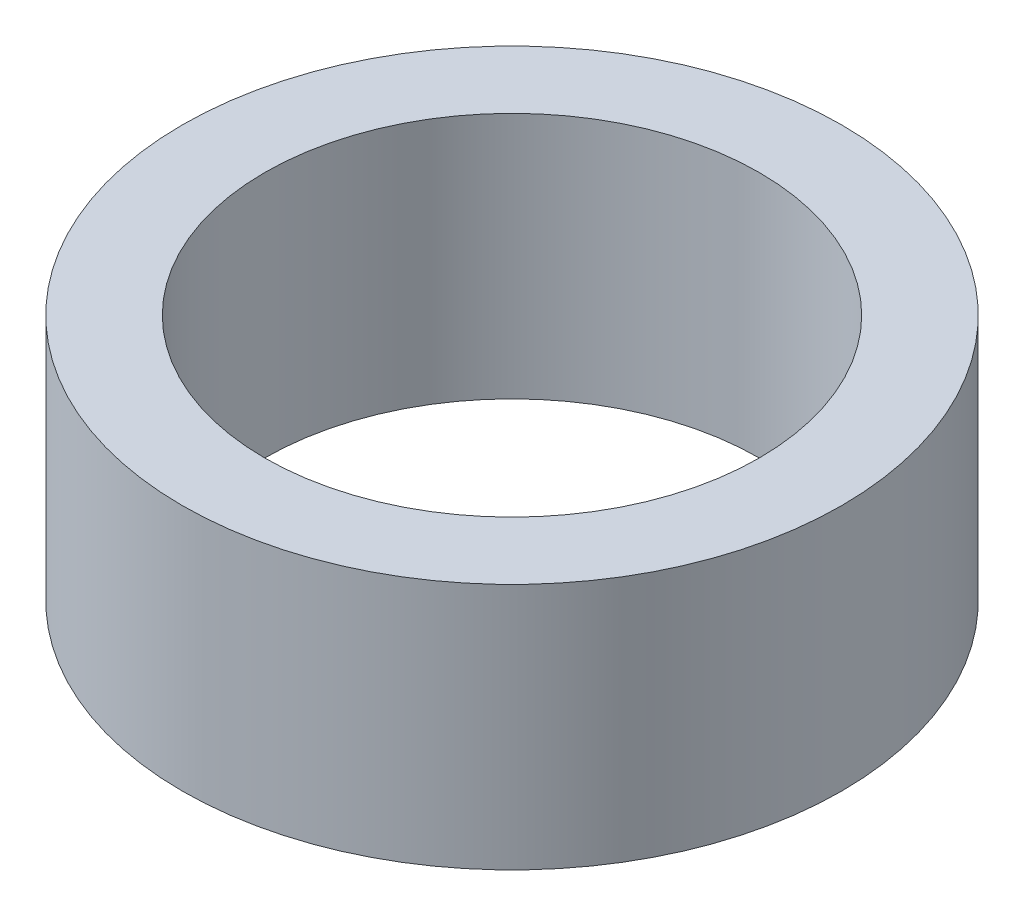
from build123d import *

# Parameters (mm, degrees)
SKETCH1_R           = 2
SKETCH1_R_2         = 1.5
BOSS_EXTRUDE1_DEPTH = 1.5


with BuildPart() as part:
    # Sketch1 → Boss-Extrude1 (new body)
    with BuildSketch(Plane(origin=(0, 0, 0), x_dir=(1, 0, 0), z_dir=(0, 1, 0))):
        with Locations(Location((0, 0, 0), (0, 0, 270))):
            Circle(SKETCH1_R)
        with Locations(Location((0, 0, 0), (0, 0, 270))):
            Circle(SKETCH1_R_2, mode=Mode.SUBTRACT)
    extrude(amount=BOSS_EXTRUDE1_DEPTH)


solid = part.part
